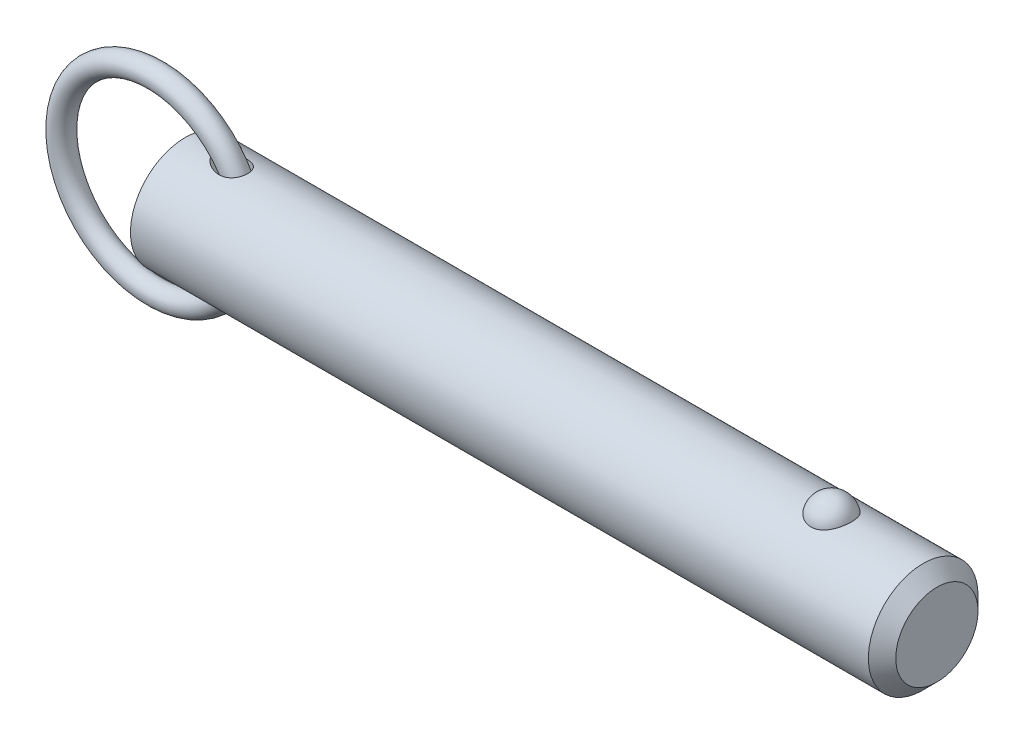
ISO-10303-21;
HEADER;
FILE_DESCRIPTION(('STEP AP214'),'2;1');
FILE_NAME('part.step','',(''),(''),'','','');
FILE_SCHEMA(('AUTOMOTIVE_DESIGN { 1 0 10303 214 1 1 1 1 }'));
ENDSEC;
DATA;
#1=APPLICATION_CONTEXT('core data for automotive mechanical design processes');
#2=APPLICATION_PROTOCOL_DEFINITION('international standard','automotive_design',2000,#1);
#3=PRODUCT_CONTEXT('',#1,'mechanical');
#4=PRODUCT('Part','Part','',(#3));
#5=PRODUCT_RELATED_PRODUCT_CATEGORY('part','',(#4));
#6=PRODUCT_DEFINITION_FORMATION('','',#4);
#7=PRODUCT_DEFINITION_CONTEXT('part definition',#1,'design');
#8=PRODUCT_DEFINITION('design','',#6,#7);
#9=PRODUCT_DEFINITION_SHAPE('','',#8);
#10=(LENGTH_UNIT() NAMED_UNIT(*) SI_UNIT(.MILLI.,.METRE.));
#11=(NAMED_UNIT(*) PLANE_ANGLE_UNIT() SI_UNIT($,.RADIAN.));
#12=(NAMED_UNIT(*) SI_UNIT($,.STERADIAN.) SOLID_ANGLE_UNIT());
#13=UNCERTAINTY_MEASURE_WITH_UNIT(LENGTH_MEASURE(1.E-05),#10,'distance_accuracy_value','');
#14=(GEOMETRIC_REPRESENTATION_CONTEXT(3) GLOBAL_UNCERTAINTY_ASSIGNED_CONTEXT((#13)) GLOBAL_UNIT_ASSIGNED_CONTEXT((#10,
#11,#12)) REPRESENTATION_CONTEXT('',''));
#15=CARTESIAN_POINT('',(0.,0.,0.));
#16=DIRECTION('',(0.,0.,1.));
#17=DIRECTION('',(1.,0.,0.));
#18=AXIS2_PLACEMENT_3D('',#15,#16,#17);
#19=CARTESIAN_POINT('',(-6.08699288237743,0.,0.));
#20=DIRECTION('',(0.,0.,1.));
#21=DIRECTION('',(1.,0.,0.));
#22=AXIS2_PLACEMENT_3D('',#19,#20,#21);
#23=TOROIDAL_SURFACE('',#22,19.05,2.223);
#24=CARTESIAN_POINT('',(15.1860071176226,0.,0.));
#25=VERTEX_POINT('',#24);
#26=VERTEX_LOOP('',#25);
#27=FACE_BOUND('',#26,.T.);
#28=ADVANCED_FACE('P0_F12',(#27),#23,.T.);
#29=CLOSED_SHELL('',(#28));
#30=MANIFOLD_SOLID_BREP('P0_B1',#29);
#31=CARTESIAN_POINT('',(0.,0.,0.));
#32=DIRECTION('',(1.,0.,0.));
#33=DIRECTION('',(0.,0.,-1.));
#34=AXIS2_PLACEMENT_3D('',#31,#32,#33);
#35=CYLINDRICAL_SURFACE('',#34,11.115);
#36=CARTESIAN_POINT('',(6.414051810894,11.0227946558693,-1.4287136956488));
#37=CARTESIAN_POINT('',(6.49338916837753,11.0115377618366,-1.51556642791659));
#38=CARTESIAN_POINT('',(6.57765461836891,10.9998263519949,-1.59789397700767));
#39=CARTESIAN_POINT('',(6.75386647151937,10.9760304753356,-1.75391400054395));
#40=CARTESIAN_POINT('',(6.84582247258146,10.9639455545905,-1.82759540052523));
#41=CARTESIAN_POINT('',(7.03627827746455,10.9397989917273,-1.96698954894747));
#42=CARTESIAN_POINT('',(7.13480838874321,10.9277377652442,-2.03266078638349));
#43=CARTESIAN_POINT('',(7.33681032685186,10.9041015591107,-2.1558582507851));
#44=CARTESIAN_POINT('',(7.44028007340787,10.8925263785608,-2.21338786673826));
#45=CARTESIAN_POINT('',(7.64386117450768,10.8710104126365,-2.31666528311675));
#46=CARTESIAN_POINT('',(7.74368989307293,10.8610119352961,-2.36295942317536));
#47=CARTESIAN_POINT('',(7.94637195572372,10.8420168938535,-2.44863486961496));
#48=CARTESIAN_POINT('',(8.04922612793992,10.8330206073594,-2.48801426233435));
#49=CARTESIAN_POINT('',(8.36115573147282,10.807980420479,-2.59542730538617));
#50=CARTESIAN_POINT('',(8.57411849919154,10.7938278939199,-2.65299817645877));
#51=CARTESIAN_POINT('',(9.00825016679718,10.7725818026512,-2.73800108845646));
#52=CARTESIAN_POINT('',(9.22947335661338,10.7655491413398,-2.76517330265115));
#53=CARTESIAN_POINT('',(9.67368141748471,10.7605872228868,-2.78445308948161));
#54=CARTESIAN_POINT('',(9.89666486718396,10.7626512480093,-2.77658653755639));
#55=CARTESIAN_POINT('',(10.2950172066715,10.7754452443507,-2.72644436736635));
#56=CARTESIAN_POINT('',(10.4712789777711,10.7844280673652,-2.69109376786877));
#57=CARTESIAN_POINT('',(10.7292776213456,10.8024982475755,-2.61722365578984));
#58=CARTESIAN_POINT('',(10.8142337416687,10.8092901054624,-2.58911576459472));
#59=CARTESIAN_POINT('',(10.9813218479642,10.8242580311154,-2.52581287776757));
#60=CARTESIAN_POINT('',(11.0634550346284,10.8324335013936,-2.49062094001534));
#61=CARTESIAN_POINT('',(11.2247418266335,10.8500287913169,-2.41281958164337));
#62=CARTESIAN_POINT('',(11.3038694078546,10.8594572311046,-2.37015806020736));
#63=CARTESIAN_POINT('',(11.4576781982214,10.8792243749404,-2.27770403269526));
#64=CARTESIAN_POINT('',(11.5323615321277,10.8895626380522,-2.22791497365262));
#65=CARTESIAN_POINT('',(11.6765388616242,10.9108113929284,-2.12140590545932));
#66=CARTESIAN_POINT('',(11.7460329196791,10.9217218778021,-2.064685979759));
#67=CARTESIAN_POINT('',(11.8790597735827,10.9437207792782,-1.94471764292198));
#68=CARTESIAN_POINT('',(11.9425932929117,10.9548091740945,-1.88147002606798));
#69=CARTESIAN_POINT('',(12.109388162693,10.9851999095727,-1.69784918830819));
#70=CARTESIAN_POINT('',(12.205655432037,11.0042655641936,-1.57093023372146));
#71=CARTESIAN_POINT('',(12.374151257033,11.0393391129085,-1.3017676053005));
#72=CARTESIAN_POINT('',(12.4463875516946,11.0553479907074,-1.15952888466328));
#73=CARTESIAN_POINT('',(12.5615818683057,11.0816338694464,-0.871972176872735));
#74=CARTESIAN_POINT('',(12.6058896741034,11.0921698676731,-0.727217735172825));
#75=CARTESIAN_POINT('',(12.6699315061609,11.1075802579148,-0.432089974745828));
#76=CARTESIAN_POINT('',(12.6896681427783,11.1124552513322,-0.281717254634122));
#77=CARTESIAN_POINT('',(12.704022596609,11.1159901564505,0.0188164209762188));
#78=CARTESIAN_POINT('',(12.6988836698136,11.1147102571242,0.168965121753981));
#79=CARTESIAN_POINT('',(12.6641681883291,11.1062126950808,0.466238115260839));
#80=CARTESIAN_POINT('',(12.6345920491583,11.0989951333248,0.613362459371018));
#81=CARTESIAN_POINT('',(12.5517453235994,11.0794095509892,0.900330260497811));
#82=CARTESIAN_POINT('',(12.4984878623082,11.0670443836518,1.0401777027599));
#83=CARTESIAN_POINT('',(12.3696588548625,11.0385082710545,1.308745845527));
#84=CARTESIAN_POINT('',(12.2940887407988,11.0223375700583,1.43746725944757));
#85=CARTESIAN_POINT('',(12.122380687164,10.987872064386,1.68079704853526));
#86=CARTESIAN_POINT('',(12.0261637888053,10.969569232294,1.79534850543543));
#87=CARTESIAN_POINT('',(11.8161707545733,10.932836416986,2.00695695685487));
#88=CARTESIAN_POINT('',(11.7023941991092,10.9144064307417,2.10401353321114));
#89=CARTESIAN_POINT('',(11.4575656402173,10.8788057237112,2.28105326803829));
#90=CARTESIAN_POINT('',(11.3261451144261,10.8616794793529,2.36053412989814));
#91=CARTESIAN_POINT('',(11.0523589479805,10.8308019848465,2.49839044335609));
#92=CARTESIAN_POINT('',(10.9099908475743,10.8170514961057,2.55676113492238));
#93=CARTESIAN_POINT('',(10.6060622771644,10.7929728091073,2.65666105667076));
#94=CARTESIAN_POINT('',(10.4438877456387,10.7830209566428,2.69640163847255));
#95=CARTESIAN_POINT('',(10.1154037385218,10.7687230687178,2.75293129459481));
#96=CARTESIAN_POINT('',(9.94909141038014,10.7643810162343,2.76970406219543));
#97=CARTESIAN_POINT('',(9.54387061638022,10.7604809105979,2.7848723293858));
#98=CARTESIAN_POINT('',(9.30446860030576,10.7637793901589,2.77227753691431));
#99=CARTESIAN_POINT('',(8.94961255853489,10.7757341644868,2.72524141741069));
#100=CARTESIAN_POINT('',(8.83186896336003,10.7808994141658,2.70482239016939));
#101=CARTESIAN_POINT('',(8.59835142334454,10.7932548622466,2.65509992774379));
#102=CARTESIAN_POINT('',(8.48257728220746,10.8004448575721,2.62579738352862));
#103=CARTESIAN_POINT('',(8.25208469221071,10.8166382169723,2.55827624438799));
#104=CARTESIAN_POINT('',(8.13740214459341,10.8256649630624,2.51994155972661));
#105=CARTESIAN_POINT('',(7.91132058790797,10.8451170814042,2.43486475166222));
#106=CARTESIAN_POINT('',(7.79992154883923,10.8555424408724,2.38812270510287));
#107=CARTESIAN_POINT('',(7.58115677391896,10.8774251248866,2.28638483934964));
#108=CARTESIAN_POINT('',(7.47378802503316,10.8888816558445,2.23139534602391));
#109=CARTESIAN_POINT('',(7.26385624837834,10.9124540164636,2.1131026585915));
#110=CARTESIAN_POINT('',(7.16129168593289,10.9245696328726,2.04980214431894));
#111=CARTESIAN_POINT('',(6.91882218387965,10.9543689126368,1.88540538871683));
#112=CARTESIAN_POINT('',(6.78193778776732,10.9721958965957,1.77979827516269));
#113=CARTESIAN_POINT('',(6.5247244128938,11.0070222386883,1.54989693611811));
#114=CARTESIAN_POINT('',(6.40436902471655,11.0240228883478,1.42563320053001));
#115=CARTESIAN_POINT('',(6.21838804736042,11.0509658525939,1.19529359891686));
#116=CARTESIAN_POINT('',(6.14691885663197,11.0615430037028,1.09404520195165));
#117=CARTESIAN_POINT('',(6.02043496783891,11.0805004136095,0.881508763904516));
#118=CARTESIAN_POINT('',(5.96539400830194,11.0888841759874,0.770237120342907));
#119=CARTESIAN_POINT('',(5.88475453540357,11.1012553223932,0.560577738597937));
#120=CARTESIAN_POINT('',(5.85559643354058,11.1057686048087,0.463603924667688));
#121=CARTESIAN_POINT('',(5.81381299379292,11.1122523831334,0.266083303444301));
#122=CARTESIAN_POINT('',(5.80117118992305,11.1142254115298,0.165540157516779));
#123=CARTESIAN_POINT('',(5.79363815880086,11.1153999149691,-0.0364747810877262));
#124=CARTESIAN_POINT('',(5.79878799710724,11.1145949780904,-0.137948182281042));
#125=CARTESIAN_POINT('',(5.82639592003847,11.1102987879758,-0.338493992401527));
#126=CARTESIAN_POINT('',(5.84887234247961,11.1068046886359,-0.437563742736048));
#127=CARTESIAN_POINT('',(5.91510741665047,11.0965857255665,-0.649968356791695));
#128=CARTESIAN_POINT('',(5.96220905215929,11.0893566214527,-0.762222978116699));
#129=CARTESIAN_POINT('',(6.0737844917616,11.072471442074,-0.977396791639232));
#130=CARTESIAN_POINT('',(6.13826787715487,11.0628140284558,-1.08031079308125));
#131=CARTESIAN_POINT('',(6.24101077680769,11.0477136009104,-1.22195806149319));
#132=CARTESIAN_POINT('',(6.27403486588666,11.042895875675,-1.26469183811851));
#133=CARTESIAN_POINT('',(6.34238022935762,11.0330152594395,-1.34817011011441));
#134=CARTESIAN_POINT('',(6.37769867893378,11.0279526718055,-1.38891694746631));
#135=CARTESIAN_POINT('',(6.414051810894,11.0227946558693,-1.4287136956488));
#136=B_SPLINE_CURVE_WITH_KNOTS('',3,(#36,#37,#38,#39,#40,#41,#42,#43,#44,#45,#46,#47,#48,#49,
#50,#51,#52,#53,#54,#55,#56,#57,#58,#59,#60,#61,#62,#63,#64,#65,#66,#67,#68,#69,#70,#71,#72,#73,
#74,#75,#76,#77,#78,#79,#80,#81,#82,#83,#84,#85,#86,#87,#88,#89,#90,#91,#92,#93,#94,#95,#96,#97,
#98,#99,#100,#101,#102,#103,#104,#105,#106,#107,#108,#109,#110,#111,#112,#113,#114,#115,#116,
#117,#118,#119,#120,#121,#122,#123,#124,#125,#126,#127,#128,#129,#130,#131,#132,#133,#134,#135),
.UNSPECIFIED.,.T.,.F.,(4,2,2,2,2,2,2,2,2,2,2,2,2,2,2,2,2,2,2,2,2,2,2,2,2,2,2,2,2,2,2,2,2,2,2,2,
2,2,2,2,2,2,2,2,2,2,2,2,2,4),(0.,0.354433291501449,0.709315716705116,1.0659654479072,
1.42246628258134,1.7536715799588,2.08496839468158,2.74582009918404,3.41227815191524,
4.07824412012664,4.61583787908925,4.88478112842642,5.1536085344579,5.42439170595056,
5.69504436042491,5.96569375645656,6.23631025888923,6.71490729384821,7.19335005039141,
7.64641437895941,8.09943057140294,8.54802575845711,8.99661331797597,9.44495256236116,
9.89326303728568,10.3433195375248,10.7933867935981,11.2550086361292,11.7167345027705,
12.2165866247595,12.7167934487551,13.4318876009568,13.7904664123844,14.1490092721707,
14.5124394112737,14.8758662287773,15.239015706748,15.6020483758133,16.1219860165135,
16.6410830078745,17.0130520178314,17.3844231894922,17.6872330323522,17.9897407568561,
18.2929471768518,18.5964749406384,18.9603532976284,19.3244326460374,19.4870338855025,
19.649438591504),.UNSPECIFIED.);
#137=CARTESIAN_POINT('',(6.414051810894,11.0227946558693,-1.4287136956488));
#138=VERTEX_POINT('',#137);
#139=EDGE_CURVE('P1_E40',#138,#138,#136,.T.);
#140=ORIENTED_EDGE('',*,*,#139,.T.);
#141=EDGE_LOOP('',(#140));
#142=FACE_BOUND('',#141,.T.);
#143=CARTESIAN_POINT('',(149.62125,0.,0.));
#144=DIRECTION('',(1.,0.,0.));
#145=DIRECTION('',(0.,0.,-1.));
#146=AXIS2_PLACEMENT_3D('',#143,#144,#145);
#147=CIRCLE('',#146,11.115);
#148=CARTESIAN_POINT('',(149.62125,0.,-11.115));
#149=VERTEX_POINT('',#148);
#150=EDGE_CURVE('P1_E25',#149,#149,#147,.T.);
#151=ORIENTED_EDGE('',*,*,#150,.F.);
#152=EDGE_LOOP('',(#151));
#153=FACE_BOUND('',#152,.T.);
#154=CARTESIAN_POINT('',(0.,0.,0.));
#155=DIRECTION('',(1.,0.,0.));
#156=DIRECTION('',(0.,0.,-1.));
#157=AXIS2_PLACEMENT_3D('',#154,#155,#156);
#158=CIRCLE('',#157,11.115);
#159=CARTESIAN_POINT('',(0.,0.,-11.115));
#160=VERTEX_POINT('',#159);
#161=EDGE_CURVE('P1_E9',#160,#160,#158,.T.);
#162=ORIENTED_EDGE('',*,*,#161,.T.);
#163=EDGE_LOOP('',(#162));
#164=FACE_BOUND('',#163,.T.);
#165=CARTESIAN_POINT('',(131.031068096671,10.3028087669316,4.17077409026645));
#166=CARTESIAN_POINT('',(130.814775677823,10.3028003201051,4.17078240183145));
#167=CARTESIAN_POINT('',(130.598548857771,10.3098895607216,4.15340593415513));
#168=CARTESIAN_POINT('',(130.172540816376,10.3373834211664,4.08449540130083));
#169=CARTESIAN_POINT('',(129.962757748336,10.3577841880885,4.0329712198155));
#170=CARTESIAN_POINT('',(129.555782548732,10.4095237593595,3.89746513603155));
#171=CARTESIAN_POINT('',(129.358572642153,10.4408466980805,3.81353029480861));
#172=CARTESIAN_POINT('',(128.981338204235,10.5110236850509,3.61560339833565));
#173=CARTESIAN_POINT('',(128.801317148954,10.5498792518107,3.50160528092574));
#174=CARTESIAN_POINT('',(128.457684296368,10.6322884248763,3.24292464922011));
#175=CARTESIAN_POINT('',(128.294686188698,10.6759443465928,3.09746040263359));
#176=CARTESIAN_POINT('',(127.994591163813,10.7625291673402,2.7817192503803));
#177=CARTESIAN_POINT('',(127.857499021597,10.8054579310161,2.61143778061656));
#178=CARTESIAN_POINT('',(127.606408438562,10.8881935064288,2.24226695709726));
#179=CARTESIAN_POINT('',(127.493710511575,10.9277761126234,2.04244123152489));
#180=CARTESIAN_POINT('',(127.301777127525,10.997484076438,1.62578254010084));
#181=CARTESIAN_POINT('',(127.222544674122,11.0276085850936,1.40894804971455));
#182=CARTESIAN_POINT('',(127.098303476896,11.0756732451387,0.961250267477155));
#183=CARTESIAN_POINT('',(127.053760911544,11.0934470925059,0.730239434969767));
#184=CARTESIAN_POINT('',(127.001569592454,11.1143331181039,0.26343964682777));
#185=CARTESIAN_POINT('',(126.993920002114,11.1174456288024,0.0276507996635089));
#186=CARTESIAN_POINT('',(127.01561056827,11.1087161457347,-0.440729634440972));
#187=CARTESIAN_POINT('',(127.044762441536,11.0969502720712,-0.6733313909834));
#188=CARTESIAN_POINT('',(127.139143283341,11.0597872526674,-1.12996621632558));
#189=CARTESIAN_POINT('',(127.204372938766,11.0343898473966,-1.35399912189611));
#190=CARTESIAN_POINT('',(127.36969844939,10.972515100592,-1.78750286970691));
#191=CARTESIAN_POINT('',(127.46983863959,10.9360236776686,-1.99695478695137));
#192=CARTESIAN_POINT('',(127.702940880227,10.8557595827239,-2.39520667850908));
#193=CARTESIAN_POINT('',(127.835905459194,10.8119863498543,-2.58400506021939));
#194=CARTESIAN_POINT('',(128.132407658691,10.7216733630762,-2.93635726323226));
#195=CARTESIAN_POINT('',(128.296056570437,10.675123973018,-3.09981510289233));
#196=CARTESIAN_POINT('',(128.649860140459,10.5846571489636,-3.39592247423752));
#197=CARTESIAN_POINT('',(128.840012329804,10.5407394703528,-3.52857487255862));
#198=CARTESIAN_POINT('',(129.23750141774,10.4616690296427,-3.75646057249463));
#199=CARTESIAN_POINT('',(129.44436705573,10.4263443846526,-3.85245432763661));
#200=CARTESIAN_POINT('',(129.872954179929,10.3675574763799,-4.00798747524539));
#201=CARTESIAN_POINT('',(130.094670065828,10.344090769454,-4.0675405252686));
#202=CARTESIAN_POINT('',(130.534669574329,10.3128282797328,-4.14614314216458));
#203=CARTESIAN_POINT('',(130.752565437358,10.3043040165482,-4.1670783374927));
#204=CARTESIAN_POINT('',(131.18894951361,10.3016771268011,-4.17357158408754));
#205=CARTESIAN_POINT('',(131.407437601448,10.3075716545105,-4.15913661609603));
#206=CARTESIAN_POINT('',(131.831744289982,10.3326686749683,-4.09636961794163));
#207=CARTESIAN_POINT('',(132.037745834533,10.3514555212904,-4.0490957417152));
#208=CARTESIAN_POINT('',(132.438576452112,10.399818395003,-3.92320197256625));
#209=CARTESIAN_POINT('',(132.6334046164,10.4293952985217,-3.84457953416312));
#210=CARTESIAN_POINT('',(133.011191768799,10.4969600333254,-3.65612410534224));
#211=CARTESIAN_POINT('',(133.193797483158,10.5351178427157,-3.54564545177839));
#212=CARTESIAN_POINT('',(133.538204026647,10.6154999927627,-3.29718036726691));
#213=CARTESIAN_POINT('',(133.700000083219,10.657725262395,-3.15918764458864));
#214=CARTESIAN_POINT('',(134.006959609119,10.744212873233,-2.85163580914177));
#215=CARTESIAN_POINT('',(134.150891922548,10.7884718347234,-2.68084605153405));
#216=CARTESIAN_POINT('',(134.409237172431,10.872374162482,-2.31721864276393));
#217=CARTESIAN_POINT('',(134.523644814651,10.9120167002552,-2.12437704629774));
#218=CARTESIAN_POINT('',(134.723873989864,10.9838919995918,-1.71516999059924));
#219=CARTESIAN_POINT('',(134.80866178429,11.0158465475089,-1.49824866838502));
#220=CARTESIAN_POINT('',(134.94268382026,11.0673523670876,-1.05228572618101));
#221=CARTESIAN_POINT('',(134.991917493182,11.086903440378,-0.823243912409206));
#222=CARTESIAN_POINT('',(135.053891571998,11.1116323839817,-0.359087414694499));
#223=CARTESIAN_POINT('',(135.066566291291,11.1167843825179,-0.123962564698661));
#224=CARTESIAN_POINT('',(135.054973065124,11.1121144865,0.345220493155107));
#225=CARTESIAN_POINT('',(135.030705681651,11.1022928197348,0.579278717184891));
#226=CARTESIAN_POINT('',(134.945907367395,11.0687504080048,1.03866534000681));
#227=CARTESIAN_POINT('',(134.885529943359,11.0450885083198,1.26402641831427));
#228=CARTESIAN_POINT('',(134.729853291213,10.9863185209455,1.70076772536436));
#229=CARTESIAN_POINT('',(134.634551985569,10.9512097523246,1.91214712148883));
#230=CARTESIAN_POINT('',(134.410397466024,10.8729733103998,2.316083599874));
#231=CARTESIAN_POINT('',(134.281380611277,10.8298068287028,2.50854240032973));
#232=CARTESIAN_POINT('',(133.992732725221,10.7401896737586,2.86808766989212));
#233=CARTESIAN_POINT('',(133.833102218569,10.6937390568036,3.03517457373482));
#234=CARTESIAN_POINT('',(133.487534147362,10.6029321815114,3.33857581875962));
#235=CARTESIAN_POINT('',(133.301708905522,10.5585680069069,3.47501541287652));
#236=CARTESIAN_POINT('',(132.907875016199,10.4769321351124,3.71390897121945));
#237=CARTESIAN_POINT('',(132.699863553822,10.439661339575,3.81635861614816));
#238=CARTESIAN_POINT('',(132.254066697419,10.3749407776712,3.98910631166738));
#239=CARTESIAN_POINT('',(132.015234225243,10.3482457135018,4.05700929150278));
#240=CARTESIAN_POINT('',(131.527925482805,10.312188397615,4.14782844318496));
#241=CARTESIAN_POINT('',(131.279453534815,10.3028184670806,4.17076454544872));
#242=CARTESIAN_POINT('',(131.031068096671,10.3028087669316,4.17077409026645));
#243=B_SPLINE_CURVE_WITH_KNOTS('',3,(#165,#166,#167,#168,#169,#170,#171,#172,#173,#174,#175,
#176,#177,#178,#179,#180,#181,#182,#183,#184,#185,#186,#187,#188,#189,#190,#191,#192,#193,#194,
#195,#196,#197,#198,#199,#200,#201,#202,#203,#204,#205,#206,#207,#208,#209,#210,#211,#212,#213,
#214,#215,#216,#217,#218,#219,#220,#221,#222,#223,#224,#225,#226,#227,#228,#229,#230,#231,#232,
#233,#234,#235,#236,#237,#238,#239,#240,#241,#242),.UNSPECIFIED.,.T.,.F.,(4,2,2,2,2,2,2,2,2,2,2,
2,2,2,2,2,2,2,2,2,2,2,2,2,2,2,2,2,2,2,2,2,2,2,2,2,2,2,4),(0.,0.64796614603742,1.29574482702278,
1.94258643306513,2.58955857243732,3.25496465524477,3.92049326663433,4.61566368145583,
5.31089647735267,6.01531821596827,6.71972398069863,7.42054043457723,8.12137023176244,
8.82309331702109,9.52487047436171,10.2292439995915,10.9335519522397,11.6223330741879,
12.3108558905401,12.9647664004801,13.6185478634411,14.252184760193,14.8858731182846,
15.5334360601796,16.1811472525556,16.8611459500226,17.5412664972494,18.2431855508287,
18.9451158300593,19.6483065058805,20.3514864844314,21.0516982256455,21.7519516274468,
22.4556690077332,23.1593743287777,23.8601491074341,24.5610129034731,25.3054529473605,
26.049562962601),.UNSPECIFIED.);
#244=CARTESIAN_POINT('',(131.031068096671,10.3028087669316,4.17077409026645));
#245=VERTEX_POINT('',#244);
#246=EDGE_CURVE('P1_E34',#245,#245,#243,.T.);
#247=ORIENTED_EDGE('',*,*,#246,.T.);
#248=EDGE_LOOP('',(#247));
#249=FACE_BOUND('',#248,.T.);
#250=CARTESIAN_POINT('',(6.414051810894,-11.0227946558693,-1.4287136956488));
#251=CARTESIAN_POINT('',(6.3312406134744,-11.0345445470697,-1.33806125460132));
#252=CARTESIAN_POINT('',(6.25372866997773,-11.0458090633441,-1.24240732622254));
#253=CARTESIAN_POINT('',(6.11277905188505,-11.0666115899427,-1.04095704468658));
#254=CARTESIAN_POINT('',(6.04933920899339,-11.0761498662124,-0.935162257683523));
#255=CARTESIAN_POINT('',(5.94029181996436,-11.0927063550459,-0.71247649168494));
#256=CARTESIAN_POINT('',(5.89492964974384,-11.0996897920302,-0.595457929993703));
#257=CARTESIAN_POINT('',(5.8449816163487,-11.1074141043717,-0.414997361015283));
#258=CARTESIAN_POINT('',(5.83135004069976,-11.1095300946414,-0.354047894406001));
#259=CARTESIAN_POINT('',(5.81051649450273,-11.1127688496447,-0.231041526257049));
#260=CARTESIAN_POINT('',(5.80331311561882,-11.1138918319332,-0.1689848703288));
#261=CARTESIAN_POINT('',(5.7929652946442,-11.1155042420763,-0.00048481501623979));
#262=CARTESIAN_POINT('',(5.79625267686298,-11.1149904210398,0.106437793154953));
#263=CARTESIAN_POINT('',(5.82213676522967,-11.1109609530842,0.317809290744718));
#264=CARTESIAN_POINT('',(5.84474662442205,-11.1074432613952,0.422256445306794));
#265=CARTESIAN_POINT('',(5.91113114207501,-11.097197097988,0.63936180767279));
#266=CARTESIAN_POINT('',(5.95733120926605,-11.090102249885,0.751250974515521));
#267=CARTESIAN_POINT('',(6.06709542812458,-11.0734770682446,0.965912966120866));
#268=CARTESIAN_POINT('',(6.13068735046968,-11.06394284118,1.06867085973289));
#269=CARTESIAN_POINT('',(6.30294237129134,-11.0385920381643,1.30890635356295));
#270=CARTESIAN_POINT('',(6.41896200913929,-11.0218881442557,1.44097376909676));
#271=CARTESIAN_POINT('',(6.66989654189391,-10.9871512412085,1.68553954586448));
#272=CARTESIAN_POINT('',(6.80485520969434,-10.9691152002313,1.79799117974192));
#273=CARTESIAN_POINT('',(7.04881236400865,-10.9382283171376,1.97587596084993));
#274=CARTESIAN_POINT('',(7.15465712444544,-10.9253240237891,2.04570822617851));
#275=CARTESIAN_POINT('',(7.37202504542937,-10.9000987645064,2.17611840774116));
#276=CARTESIAN_POINT('',(7.48355057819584,-10.8877780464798,2.23669241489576));
#277=CARTESIAN_POINT('',(7.71132418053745,-10.8641580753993,2.34873831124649));
#278=CARTESIAN_POINT('',(7.82757727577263,-10.8528599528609,2.40020018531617));
#279=CARTESIAN_POINT('',(8.0638682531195,-10.8317234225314,2.49385169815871));
#280=CARTESIAN_POINT('',(8.18390558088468,-10.8218848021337,2.53604268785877));
#281=CARTESIAN_POINT('',(8.42918336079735,-10.8039208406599,2.61152283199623));
#282=CARTESIAN_POINT('',(8.55447802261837,-10.7958283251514,2.64464414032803));
#283=CARTESIAN_POINT('',(8.8075212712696,-10.781995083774,2.70048793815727));
#284=CARTESIAN_POINT('',(8.93527019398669,-10.7762546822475,2.72320899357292));
#285=CARTESIAN_POINT('',(9.19210176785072,-10.7675291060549,2.75750994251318));
#286=CARTESIAN_POINT('',(9.32118105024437,-10.7645381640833,2.76911315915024));
#287=CARTESIAN_POINT('',(9.57984338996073,-10.761622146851,2.78042035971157));
#288=CARTESIAN_POINT('',(9.70942621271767,-10.7616957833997,2.78012934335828));
#289=CARTESIAN_POINT('',(10.0243125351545,-10.7659059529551,2.76381534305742));
#290=CARTESIAN_POINT('',(10.209307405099,-10.7717977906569,2.74099674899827));
#291=CARTESIAN_POINT('',(10.5731188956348,-10.7905408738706,2.66626238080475));
#292=CARTESIAN_POINT('',(10.7519389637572,-10.8033881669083,2.61436313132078));
#293=CARTESIAN_POINT('',(11.0114289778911,-10.8271584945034,2.51336808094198));
#294=CARTESIAN_POINT('',(11.096831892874,-10.835881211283,2.47562331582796));
#295=CARTESIAN_POINT('',(11.2636000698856,-10.8545688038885,2.39236170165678));
#296=CARTESIAN_POINT('',(11.3449673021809,-10.8645330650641,2.3468486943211));
#297=CARTESIAN_POINT('',(11.5027832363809,-10.8853818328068,2.24815967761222));
#298=CARTESIAN_POINT('',(11.5792327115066,-10.8962661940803,2.19498487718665));
#299=CARTESIAN_POINT('',(11.7263315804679,-10.9185541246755,2.08128855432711));
#300=CARTESIAN_POINT('',(11.7969818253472,-10.9299576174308,2.02076811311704));
#301=CARTESIAN_POINT('',(11.9817953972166,-10.9613645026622,1.84513663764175));
#302=CARTESIAN_POINT('',(12.0893012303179,-10.9814643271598,1.72286660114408));
#303=CARTESIAN_POINT('',(12.2803576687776,-11.0193991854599,1.46066991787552));
#304=CARTESIAN_POINT('',(12.3639173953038,-11.0372350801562,1.32075002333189));
#305=CARTESIAN_POINT('',(12.4996220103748,-11.0672969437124,1.03778067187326));
#306=CARTESIAN_POINT('',(12.5535315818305,-11.0798242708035,0.895607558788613));
#307=CARTESIAN_POINT('',(12.636874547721,-11.0995427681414,0.603918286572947));
#308=CARTESIAN_POINT('',(12.6663115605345,-11.1067347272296,0.45440321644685));
#309=CARTESIAN_POINT('',(12.6997387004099,-11.1149224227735,0.154577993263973));
#310=CARTESIAN_POINT('',(12.7040886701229,-11.1160057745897,0.00431019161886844));
#311=CARTESIAN_POINT('',(12.6882048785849,-11.1120956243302,-0.294841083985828));
#312=CARTESIAN_POINT('',(12.6679715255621,-11.1071022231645,-0.443724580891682));
#313=CARTESIAN_POINT('',(12.6034470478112,-11.0915888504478,-0.735688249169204));
#314=CARTESIAN_POINT('',(12.5591858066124,-11.0810757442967,-0.878775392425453));
#315=CARTESIAN_POINT('',(12.4477416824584,-11.0556687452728,-1.15529525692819));
#316=CARTESIAN_POINT('',(12.3805601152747,-11.0407751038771,-1.2887285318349));
#317=CARTESIAN_POINT('',(12.2248919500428,-11.0081839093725,-1.54257976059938));
#318=CARTESIAN_POINT('',(12.1363549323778,-10.9904797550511,-1.66296592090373));
#319=CARTESIAN_POINT('',(11.9406137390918,-10.9541951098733,-1.88726577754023));
#320=CARTESIAN_POINT('',(11.833409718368,-10.9356146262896,-1.99117961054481));
#321=CARTESIAN_POINT('',(11.601318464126,-10.8991360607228,-2.18213646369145));
#322=CARTESIAN_POINT('',(11.4761325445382,-10.8812577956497,-2.26881927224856));
#323=CARTESIAN_POINT('',(11.2134852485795,-10.8482871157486,-2.42157282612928));
#324=CARTESIAN_POINT('',(11.0760218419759,-10.8331951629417,-2.48764015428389));
#325=CARTESIAN_POINT('',(10.7828968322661,-10.8061050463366,-2.60290068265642));
#326=CARTESIAN_POINT('',(10.6266338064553,-10.7943907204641,-2.65062248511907));
#327=CARTESIAN_POINT('',(10.3086617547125,-10.7762429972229,-2.72345054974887));
#328=CARTESIAN_POINT('',(10.146948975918,-10.7698133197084,-2.74854088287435));
#329=CARTESIAN_POINT('',(9.75541304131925,-10.7608036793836,-2.78368719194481));
#330=CARTESIAN_POINT('',(9.52459435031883,-10.7608467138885,-2.78350276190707));
#331=CARTESIAN_POINT('',(9.0660496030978,-10.7702674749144,-2.74677945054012));
#332=CARTESIAN_POINT('',(8.83832966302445,-10.7796615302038,-2.71017697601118));
#333=CARTESIAN_POINT('',(8.38783466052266,-10.8058248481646,-2.60392490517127));
#334=CARTESIAN_POINT('',(8.16517101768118,-10.8226939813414,-2.53382676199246));
#335=CARTESIAN_POINT('',(7.84087311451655,-10.8516548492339,-2.40555545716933));
#336=CARTESIAN_POINT('',(7.73435551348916,-10.8619221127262,-2.35892455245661));
#337=CARTESIAN_POINT('',(7.52510420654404,-10.883357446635,-2.25797017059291));
#338=CARTESIAN_POINT('',(7.42236986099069,-10.8945253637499,-2.20364800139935));
#339=CARTESIAN_POINT('',(7.23808758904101,-10.915528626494,-2.09688018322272));
#340=CARTESIAN_POINT('',(7.15584631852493,-10.9252787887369,-2.04561072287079));
#341=CARTESIAN_POINT('',(6.99510576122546,-10.944960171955,-1.93754729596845));
#342=CARTESIAN_POINT('',(6.91660574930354,-10.9548913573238,-1.88075440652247));
#343=CARTESIAN_POINT('',(6.76418133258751,-10.974690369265,-1.7615450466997));
#344=CARTESIAN_POINT('',(6.69024940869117,-10.9845582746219,-1.69913825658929));
#345=CARTESIAN_POINT('',(6.54780119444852,-11.0039826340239,-1.56842485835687));
#346=CARTESIAN_POINT('',(6.47928247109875,-11.0135392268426,-1.50012092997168));
#347=CARTESIAN_POINT('',(6.414051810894,-11.0227946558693,-1.4287136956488));
#348=B_SPLINE_CURVE_WITH_KNOTS('',3,(#250,#251,#252,#253,#254,#255,#256,#257,#258,#259,#260,
#261,#262,#263,#264,#265,#266,#267,#268,#269,#270,#271,#272,#273,#274,#275,#276,#277,#278,#279,
#280,#281,#282,#283,#284,#285,#286,#287,#288,#289,#290,#291,#292,#293,#294,#295,#296,#297,#298,
#299,#300,#301,#302,#303,#304,#305,#306,#307,#308,#309,#310,#311,#312,#313,#314,#315,#316,#317,
#318,#319,#320,#321,#322,#323,#324,#325,#326,#327,#328,#329,#330,#331,#332,#333,#334,#335,#336,
#337,#338,#339,#340,#341,#342,#343,#344,#345,#346,#347),.UNSPECIFIED.,.T.,.F.,(4,2,2,2,2,2,2,2,
2,2,2,2,2,2,2,2,2,2,2,2,2,2,2,2,2,2,2,2,2,2,2,2,2,2,2,2,2,2,2,2,2,2,2,2,2,2,2,2,4),(0.,
0.36983565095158,0.739614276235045,1.1142538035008,1.30141910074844,1.48854338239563,
1.8074587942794,2.12659146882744,2.4883888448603,2.85076733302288,3.3776216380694,
3.9057143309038,4.287639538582,4.66972556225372,5.05222896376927,5.43467659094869,
5.82378546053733,6.21294796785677,6.6012922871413,6.98947336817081,7.54669558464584,
8.10360148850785,8.3845853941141,8.66543074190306,8.94623182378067,9.22699162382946,
9.71628887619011,10.2053995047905,10.6608871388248,11.1163074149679,11.5651786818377,
12.0140424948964,12.4623493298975,12.9106304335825,13.3599804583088,13.8093267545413,
14.2672570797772,14.7252632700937,15.214740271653,15.7045615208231,16.3932594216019,
17.083162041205,17.7825738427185,18.1325177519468,18.4824022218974,18.7744056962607,
19.0663523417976,19.3578048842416,19.6491256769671),.UNSPECIFIED.);
#349=CARTESIAN_POINT('',(6.414051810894,-11.0227946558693,-1.4287136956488));
#350=VERTEX_POINT('',#349);
#351=EDGE_CURVE('P1_E17',#350,#350,#348,.T.);
#352=ORIENTED_EDGE('',*,*,#351,.T.);
#353=EDGE_LOOP('',(#352));
#354=FACE_BOUND('',#353,.T.);
#355=ADVANCED_FACE('P1_F13',(#142,#153,#164,#249,#354),#35,.T.);
#356=CARTESIAN_POINT('',(0.,0.,0.));
#357=DIRECTION('',(-1.,0.,0.));
#358=DIRECTION('',(0.,0.,1.));
#359=AXIS2_PLACEMENT_3D('',#356,#357,#358);
#360=PLANE('',#359);
#361=ORIENTED_EDGE('',*,*,#161,.F.);
#362=EDGE_LOOP('',(#361));
#363=FACE_BOUND('',#362,.T.);
#364=ADVANCED_FACE('P1_F15',(#363),#360,.T.);
#365=CARTESIAN_POINT('',(152.4,0.,0.));
#366=DIRECTION('',(-1.,0.,0.));
#367=DIRECTION('',(0.,0.,1.));
#368=AXIS2_PLACEMENT_3D('',#365,#366,#367);
#369=CONICAL_SURFACE('',#368,8.33625000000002,0.78539816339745);
#370=ORIENTED_EDGE('',*,*,#150,.T.);
#371=EDGE_LOOP('',(#370));
#372=FACE_BOUND('',#371,.T.);
#373=CARTESIAN_POINT('',(152.4,0.,0.));
#374=DIRECTION('',(1.,0.,0.));
#375=DIRECTION('',(0.,0.,-1.));
#376=AXIS2_PLACEMENT_3D('',#373,#374,#375);
#377=CIRCLE('',#376,8.33625000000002);
#378=CARTESIAN_POINT('',(152.4,0.,-8.33625000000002));
#379=VERTEX_POINT('',#378);
#380=EDGE_CURVE('P1_E30',#379,#379,#377,.T.);
#381=ORIENTED_EDGE('',*,*,#380,.F.);
#382=EDGE_LOOP('',(#381));
#383=FACE_BOUND('',#382,.T.);
#384=ADVANCED_FACE('P1_F55',(#372,#383),#369,.T.);
#385=CARTESIAN_POINT('',(152.4,8.33625000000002,0.));
#386=DIRECTION('',(1.,0.,0.));
#387=DIRECTION('',(0.,0.,-1.));
#388=AXIS2_PLACEMENT_3D('',#385,#386,#387);
#389=PLANE('',#388);
#390=ORIENTED_EDGE('',*,*,#380,.T.);
#391=EDGE_LOOP('',(#390));
#392=FACE_BOUND('',#391,.T.);
#393=ADVANCED_FACE('P1_F51',(#392),#389,.T.);
#394=CARTESIAN_POINT('',(131.031068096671,10.0035,0.));
#395=DIRECTION('',(-1.,0.,0.));
#396=DIRECTION('',(0.,1.,0.));
#397=AXIS2_PLACEMENT_3D('',#394,#395,#396);
#398=SPHERICAL_SURFACE('',#397,4.18150000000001);
#399=ORIENTED_EDGE('',*,*,#246,.F.);
#400=EDGE_LOOP('',(#399));
#401=FACE_BOUND('',#400,.T.);
#402=ADVANCED_FACE('P1_F46',(#401),#398,.T.);
#403=CARTESIAN_POINT('',(-6.08699288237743,0.,0.));
#404=DIRECTION('',(0.,0.,1.));
#405=DIRECTION('',(1.,0.,0.));
#406=AXIS2_PLACEMENT_3D('',#403,#404,#405);
#407=TOROIDAL_SURFACE('',#406,19.05,2.77875);
#408=ORIENTED_EDGE('',*,*,#351,.F.);
#409=EDGE_LOOP('',(#408));
#410=FACE_BOUND('',#409,.T.);
#411=ORIENTED_EDGE('',*,*,#139,.F.);
#412=EDGE_LOOP('',(#411));
#413=FACE_BOUND('',#412,.T.);
#414=ADVANCED_FACE('P1_F50',(#410,#413),#407,.F.);
#415=CLOSED_SHELL('',(#355,#364,#384,#393,#402,#414));
#416=MANIFOLD_SOLID_BREP('P1_B1',#415);
#417=ADVANCED_BREP_SHAPE_REPRESENTATION('',(#18,#30,#416),#14);
#418=SHAPE_DEFINITION_REPRESENTATION(#9,#417);
ENDSEC;
END-ISO-10303-21;
